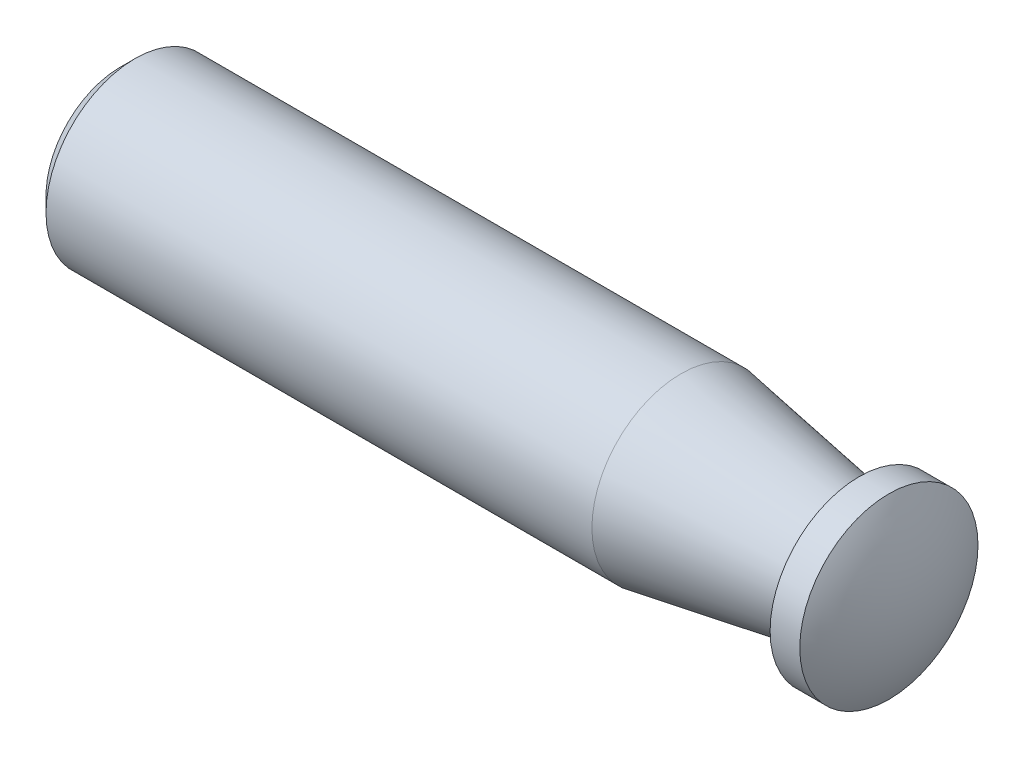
ISO-10303-21;
HEADER;
FILE_DESCRIPTION(('STEP AP214'),'2;1');
FILE_NAME('part.step','',(''),(''),'','','');
FILE_SCHEMA(('AUTOMOTIVE_DESIGN { 1 0 10303 214 1 1 1 1 }'));
ENDSEC;
DATA;
#1=APPLICATION_CONTEXT('core data for automotive mechanical design processes');
#2=APPLICATION_PROTOCOL_DEFINITION('international standard','automotive_design',2000,#1);
#3=PRODUCT_CONTEXT('',#1,'mechanical');
#4=PRODUCT('Part','Part','',(#3));
#5=PRODUCT_RELATED_PRODUCT_CATEGORY('part','',(#4));
#6=PRODUCT_DEFINITION_FORMATION('','',#4);
#7=PRODUCT_DEFINITION_CONTEXT('part definition',#1,'design');
#8=PRODUCT_DEFINITION('design','',#6,#7);
#9=PRODUCT_DEFINITION_SHAPE('','',#8);
#10=(LENGTH_UNIT() NAMED_UNIT(*) SI_UNIT(.MILLI.,.METRE.));
#11=(NAMED_UNIT(*) PLANE_ANGLE_UNIT() SI_UNIT($,.RADIAN.));
#12=(NAMED_UNIT(*) SI_UNIT($,.STERADIAN.) SOLID_ANGLE_UNIT());
#13=UNCERTAINTY_MEASURE_WITH_UNIT(LENGTH_MEASURE(1.E-05),#10,'distance_accuracy_value','');
#14=(GEOMETRIC_REPRESENTATION_CONTEXT(3) GLOBAL_UNCERTAINTY_ASSIGNED_CONTEXT((#13)) GLOBAL_UNIT_ASSIGNED_CONTEXT((#10,
#11,#12)) REPRESENTATION_CONTEXT('',''));
#15=CARTESIAN_POINT('',(0.,0.,0.));
#16=DIRECTION('',(0.,0.,1.));
#17=DIRECTION('',(1.,0.,0.));
#18=AXIS2_PLACEMENT_3D('',#15,#16,#17);
#19=CARTESIAN_POINT('',(0.,0.,0.));
#20=DIRECTION('',(1.,0.,0.));
#21=DIRECTION('',(0.,0.,-1.));
#22=AXIS2_PLACEMENT_3D('',#19,#20,#21);
#23=PLANE('',#22);
#24=CARTESIAN_POINT('',(0.,0.,0.));
#25=DIRECTION('',(1.,0.,0.));
#26=DIRECTION('',(0.,0.,-1.));
#27=AXIS2_PLACEMENT_3D('',#24,#25,#26);
#28=CIRCLE('',#27,2.5);
#29=CARTESIAN_POINT('',(0.,0.,-2.5));
#30=VERTEX_POINT('',#29);
#31=EDGE_CURVE('E36',#30,#30,#28,.F.);
#32=ORIENTED_EDGE('',*,*,#31,.T.);
#33=EDGE_LOOP('',(#32));
#34=FACE_BOUND('',#33,.T.);
#35=ADVANCED_FACE('F30',(#34),#23,.F.);
#36=CARTESIAN_POINT('',(-25.074358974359,0.,0.));
#37=DIRECTION('',(-1.,0.,0.));
#38=DIRECTION('',(0.,0.,1.));
#39=AXIS2_PLACEMENT_3D('',#36,#37,#38);
#40=CYLINDRICAL_SURFACE('',#39,3.);
#41=CARTESIAN_POINT('',(0.5,0.,0.));
#42=DIRECTION('',(1.,0.,0.));
#43=DIRECTION('',(0.,0.,-1.));
#44=AXIS2_PLACEMENT_3D('',#41,#42,#43);
#45=CIRCLE('',#44,3.);
#46=CARTESIAN_POINT('',(0.5,0.,-3.));
#47=VERTEX_POINT('',#46);
#48=EDGE_CURVE('E10',#47,#47,#45,.T.);
#49=ORIENTED_EDGE('',*,*,#48,.T.);
#50=EDGE_LOOP('',(#49));
#51=FACE_BOUND('',#50,.T.);
#52=CARTESIAN_POINT('',(18.88,0.,0.));
#53=DIRECTION('',(-1.,0.,0.));
#54=DIRECTION('',(0.,0.,1.));
#55=AXIS2_PLACEMENT_3D('',#52,#53,#54);
#56=CIRCLE('',#55,3.);
#57=CARTESIAN_POINT('',(18.88,0.,3.));
#58=VERTEX_POINT('',#57);
#59=EDGE_CURVE('E40',#58,#58,#56,.T.);
#60=ORIENTED_EDGE('',*,*,#59,.T.);
#61=EDGE_LOOP('',(#60));
#62=FACE_BOUND('',#61,.T.);
#63=ADVANCED_FACE('F73',(#51,#62),#40,.T.);
#64=CARTESIAN_POINT('',(24.88,0.,0.));
#65=DIRECTION('',(-1.,0.,0.));
#66=DIRECTION('',(0.,0.,1.));
#67=AXIS2_PLACEMENT_3D('',#64,#65,#66);
#68=CONICAL_SURFACE('',#67,2.,0.165148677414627);
#69=ORIENTED_EDGE('',*,*,#59,.F.);
#70=EDGE_LOOP('',(#69));
#71=FACE_BOUND('',#70,.T.);
#72=CARTESIAN_POINT('',(24.88,0.,0.));
#73=DIRECTION('',(-1.,0.,0.));
#74=DIRECTION('',(0.,0.,1.));
#75=AXIS2_PLACEMENT_3D('',#72,#73,#74);
#76=CIRCLE('',#75,2.);
#77=CARTESIAN_POINT('',(24.88,0.,2.));
#78=VERTEX_POINT('',#77);
#79=EDGE_CURVE('E44',#78,#78,#76,.T.);
#80=ORIENTED_EDGE('',*,*,#79,.T.);
#81=EDGE_LOOP('',(#80));
#82=FACE_BOUND('',#81,.T.);
#83=ADVANCED_FACE('F77',(#71,#82),#68,.T.);
#84=CARTESIAN_POINT('',(24.88,2.,0.));
#85=DIRECTION('',(1.,0.,0.));
#86=DIRECTION('',(0.,0.,-1.));
#87=AXIS2_PLACEMENT_3D('',#84,#85,#86);
#88=PLANE('',#87);
#89=ORIENTED_EDGE('',*,*,#79,.F.);
#90=EDGE_LOOP('',(#89));
#91=FACE_BOUND('',#90,.T.);
#92=CARTESIAN_POINT('',(24.88,0.,0.));
#93=DIRECTION('',(-1.,0.,0.));
#94=DIRECTION('',(0.,0.,1.));
#95=AXIS2_PLACEMENT_3D('',#92,#93,#94);
#96=CIRCLE('',#95,3.);
#97=CARTESIAN_POINT('',(24.88,0.,3.));
#98=VERTEX_POINT('',#97);
#99=EDGE_CURVE('E49',#98,#98,#96,.T.);
#100=ORIENTED_EDGE('',*,*,#99,.T.);
#101=EDGE_LOOP('',(#100));
#102=FACE_BOUND('',#101,.T.);
#103=ADVANCED_FACE('F69',(#91,#102),#88,.F.);
#104=CARTESIAN_POINT('',(-25.074358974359,0.,0.));
#105=DIRECTION('',(-1.,0.,0.));
#106=DIRECTION('',(0.,0.,1.));
#107=AXIS2_PLACEMENT_3D('',#104,#105,#106);
#108=CYLINDRICAL_SURFACE('',#107,3.);
#109=ORIENTED_EDGE('',*,*,#99,.F.);
#110=EDGE_LOOP('',(#109));
#111=FACE_BOUND('',#110,.T.);
#112=CARTESIAN_POINT('',(25.88,0.,0.));
#113=DIRECTION('',(-1.,0.,0.));
#114=DIRECTION('',(0.,0.,1.));
#115=AXIS2_PLACEMENT_3D('',#112,#113,#114);
#116=CIRCLE('',#115,3.);
#117=CARTESIAN_POINT('',(25.88,0.,3.));
#118=VERTEX_POINT('',#117);
#119=EDGE_CURVE('E53',#118,#118,#116,.T.);
#120=ORIENTED_EDGE('',*,*,#119,.T.);
#121=EDGE_LOOP('',(#120));
#122=FACE_BOUND('',#121,.T.);
#123=ADVANCED_FACE('F57',(#111,#122),#108,.T.);
#124=CARTESIAN_POINT('',(20.88,0.,0.));
#125=DIRECTION('',(-1.,0.,0.));
#126=DIRECTION('',(0.,1.,0.));
#127=AXIS2_PLACEMENT_3D('',#124,#125,#126);
#128=SPHERICAL_SURFACE('',#127,5.83095189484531);
#129=ORIENTED_EDGE('',*,*,#119,.F.);
#130=EDGE_LOOP('',(#129));
#131=FACE_BOUND('',#130,.T.);
#132=ADVANCED_FACE('F59',(#131),#128,.T.);
#133=CARTESIAN_POINT('',(0.,0.,0.));
#134=DIRECTION('',(1.,0.,0.));
#135=DIRECTION('',(0.,0.,-1.));
#136=AXIS2_PLACEMENT_3D('',#133,#134,#135);
#137=CONICAL_SURFACE('',#136,2.5,0.785398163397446);
#138=ORIENTED_EDGE('',*,*,#48,.F.);
#139=EDGE_LOOP('',(#138));
#140=FACE_BOUND('',#139,.T.);
#141=ORIENTED_EDGE('',*,*,#31,.F.);
#142=EDGE_LOOP('',(#141));
#143=FACE_BOUND('',#142,.T.);
#144=ADVANCED_FACE('F61',(#140,#143),#137,.T.);
#145=CLOSED_SHELL('',(#35,#63,#83,#103,#123,#132,#144));
#146=MANIFOLD_SOLID_BREP('B2',#145);
#147=ADVANCED_BREP_SHAPE_REPRESENTATION('',(#18,#146),#14);
#148=SHAPE_DEFINITION_REPRESENTATION(#9,#147);
ENDSEC;
END-ISO-10303-21;
